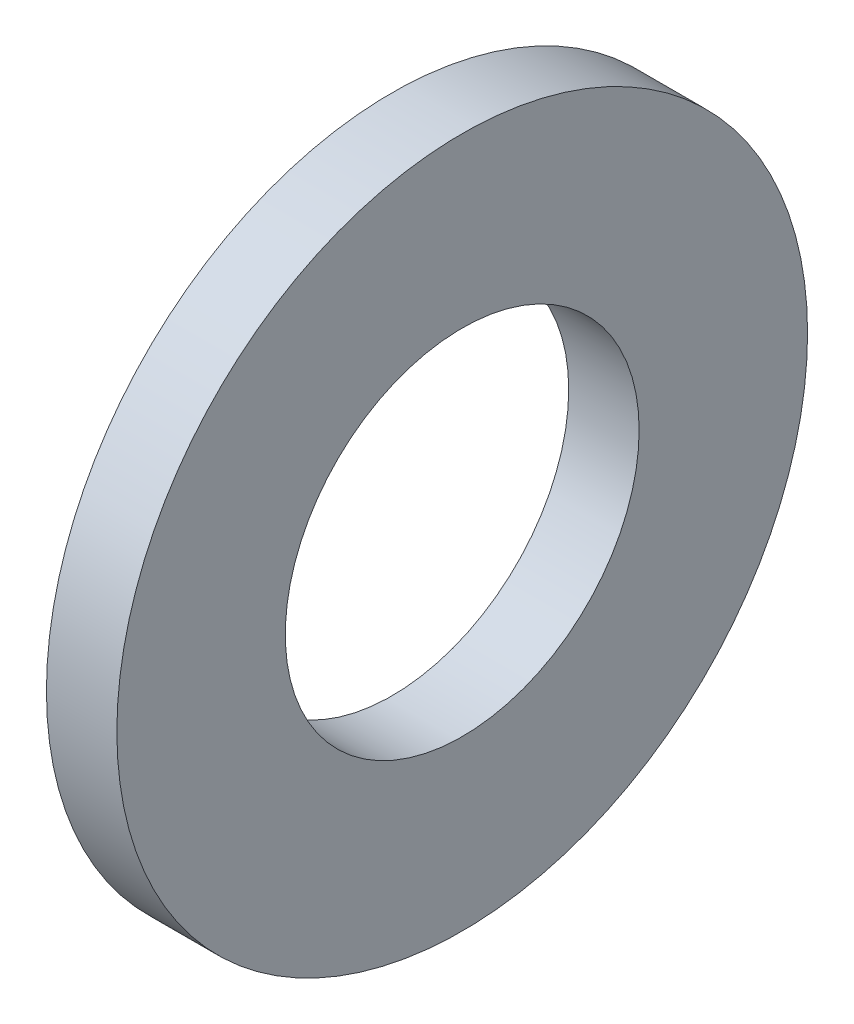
ISO-10303-21;
HEADER;
FILE_DESCRIPTION(('STEP AP214'),'2;1');
FILE_NAME('part.step','',(''),(''),'','','');
FILE_SCHEMA(('AUTOMOTIVE_DESIGN { 1 0 10303 214 1 1 1 1 }'));
ENDSEC;
DATA;
#1=APPLICATION_CONTEXT('core data for automotive mechanical design processes');
#2=APPLICATION_PROTOCOL_DEFINITION('international standard','automotive_design',2000,#1);
#3=PRODUCT_CONTEXT('',#1,'mechanical');
#4=PRODUCT('Part','Part','',(#3));
#5=PRODUCT_RELATED_PRODUCT_CATEGORY('part','',(#4));
#6=PRODUCT_DEFINITION_FORMATION('','',#4);
#7=PRODUCT_DEFINITION_CONTEXT('part definition',#1,'design');
#8=PRODUCT_DEFINITION('design','',#6,#7);
#9=PRODUCT_DEFINITION_SHAPE('','',#8);
#10=(LENGTH_UNIT() NAMED_UNIT(*) SI_UNIT(.MILLI.,.METRE.));
#11=(NAMED_UNIT(*) PLANE_ANGLE_UNIT() SI_UNIT($,.RADIAN.));
#12=(NAMED_UNIT(*) SI_UNIT($,.STERADIAN.) SOLID_ANGLE_UNIT());
#13=UNCERTAINTY_MEASURE_WITH_UNIT(LENGTH_MEASURE(1.E-05),#10,'distance_accuracy_value','');
#14=(GEOMETRIC_REPRESENTATION_CONTEXT(3) GLOBAL_UNCERTAINTY_ASSIGNED_CONTEXT((#13)) GLOBAL_UNIT_ASSIGNED_CONTEXT((#10,
#11,#12)) REPRESENTATION_CONTEXT('',''));
#15=CARTESIAN_POINT('',(0.,0.,0.));
#16=DIRECTION('',(0.,0.,1.));
#17=DIRECTION('',(1.,0.,0.));
#18=AXIS2_PLACEMENT_3D('',#15,#16,#17);
#19=CARTESIAN_POINT('',(1.2,0.,0.));
#20=DIRECTION('',(1.,0.,0.));
#21=DIRECTION('',(0.,0.,-1.));
#22=AXIS2_PLACEMENT_3D('',#19,#20,#21);
#23=PLANE('',#22);
#24=CARTESIAN_POINT('',(1.2,0.,0.));
#25=DIRECTION('',(1.,0.,0.));
#26=DIRECTION('',(0.,0.,-1.));
#27=AXIS2_PLACEMENT_3D('',#24,#25,#26);
#28=CIRCLE('',#27,5.885);
#29=CARTESIAN_POINT('',(1.2,0.,-5.885));
#30=VERTEX_POINT('',#29);
#31=EDGE_CURVE('E10',#30,#30,#28,.T.);
#32=ORIENTED_EDGE('',*,*,#31,.T.);
#33=EDGE_LOOP('',(#32));
#34=FACE_BOUND('',#33,.T.);
#35=CARTESIAN_POINT('',(1.2,0.,0.));
#36=DIRECTION('',(1.,0.,0.));
#37=DIRECTION('',(0.,0.,-1.));
#38=AXIS2_PLACEMENT_3D('',#35,#36,#37);
#39=CIRCLE('',#38,3.015);
#40=CARTESIAN_POINT('',(1.2,0.,-3.015));
#41=VERTEX_POINT('',#40);
#42=EDGE_CURVE('E42',#41,#41,#39,.T.);
#43=ORIENTED_EDGE('',*,*,#42,.F.);
#44=EDGE_LOOP('',(#43));
#45=FACE_BOUND('',#44,.T.);
#46=ADVANCED_FACE('F31',(#34,#45),#23,.T.);
#47=CARTESIAN_POINT('',(0.,0.,0.));
#48=DIRECTION('',(1.,0.,0.));
#49=DIRECTION('',(0.,0.,-1.));
#50=AXIS2_PLACEMENT_3D('',#47,#48,#49);
#51=PLANE('',#50);
#52=CARTESIAN_POINT('',(0.,0.,0.));
#53=DIRECTION('',(1.,0.,0.));
#54=DIRECTION('',(0.,0.,-1.));
#55=AXIS2_PLACEMENT_3D('',#52,#53,#54);
#56=CIRCLE('',#55,5.885);
#57=CARTESIAN_POINT('',(0.,0.,-5.885));
#58=VERTEX_POINT('',#57);
#59=EDGE_CURVE('E35',#58,#58,#56,.T.);
#60=ORIENTED_EDGE('',*,*,#59,.F.);
#61=EDGE_LOOP('',(#60));
#62=FACE_BOUND('',#61,.T.);
#63=CARTESIAN_POINT('',(0.,0.,0.));
#64=DIRECTION('',(1.,0.,0.));
#65=DIRECTION('',(0.,0.,-1.));
#66=AXIS2_PLACEMENT_3D('',#63,#64,#65);
#67=CIRCLE('',#66,3.015);
#68=CARTESIAN_POINT('',(0.,0.,-3.015));
#69=VERTEX_POINT('',#68);
#70=EDGE_CURVE('E44',#69,#69,#67,.T.);
#71=ORIENTED_EDGE('',*,*,#70,.T.);
#72=EDGE_LOOP('',(#71));
#73=FACE_BOUND('',#72,.T.);
#74=ADVANCED_FACE('F54',(#62,#73),#51,.F.);
#75=CARTESIAN_POINT('',(1.2,0.,0.));
#76=DIRECTION('',(-1.,0.,0.));
#77=DIRECTION('',(0.,0.,1.));
#78=AXIS2_PLACEMENT_3D('',#75,#76,#77);
#79=CYLINDRICAL_SURFACE('',#78,5.885);
#80=ORIENTED_EDGE('',*,*,#31,.F.);
#81=EDGE_LOOP('',(#80));
#82=FACE_BOUND('',#81,.T.);
#83=ORIENTED_EDGE('',*,*,#59,.T.);
#84=EDGE_LOOP('',(#83));
#85=FACE_BOUND('',#84,.T.);
#86=ADVANCED_FACE('F33',(#82,#85),#79,.T.);
#87=CARTESIAN_POINT('',(1.2,0.,0.));
#88=DIRECTION('',(-1.,0.,0.));
#89=DIRECTION('',(0.,0.,1.));
#90=AXIS2_PLACEMENT_3D('',#87,#88,#89);
#91=CYLINDRICAL_SURFACE('',#90,3.015);
#92=ORIENTED_EDGE('',*,*,#42,.T.);
#93=EDGE_LOOP('',(#92));
#94=FACE_BOUND('',#93,.T.);
#95=ORIENTED_EDGE('',*,*,#70,.F.);
#96=EDGE_LOOP('',(#95));
#97=FACE_BOUND('',#96,.T.);
#98=ADVANCED_FACE('F50',(#94,#97),#91,.F.);
#99=CLOSED_SHELL('',(#46,#74,#86,#98));
#100=MANIFOLD_SOLID_BREP('B2',#99);
#101=ADVANCED_BREP_SHAPE_REPRESENTATION('',(#18,#100),#14);
#102=SHAPE_DEFINITION_REPRESENTATION(#9,#101);
ENDSEC;
END-ISO-10303-21;
